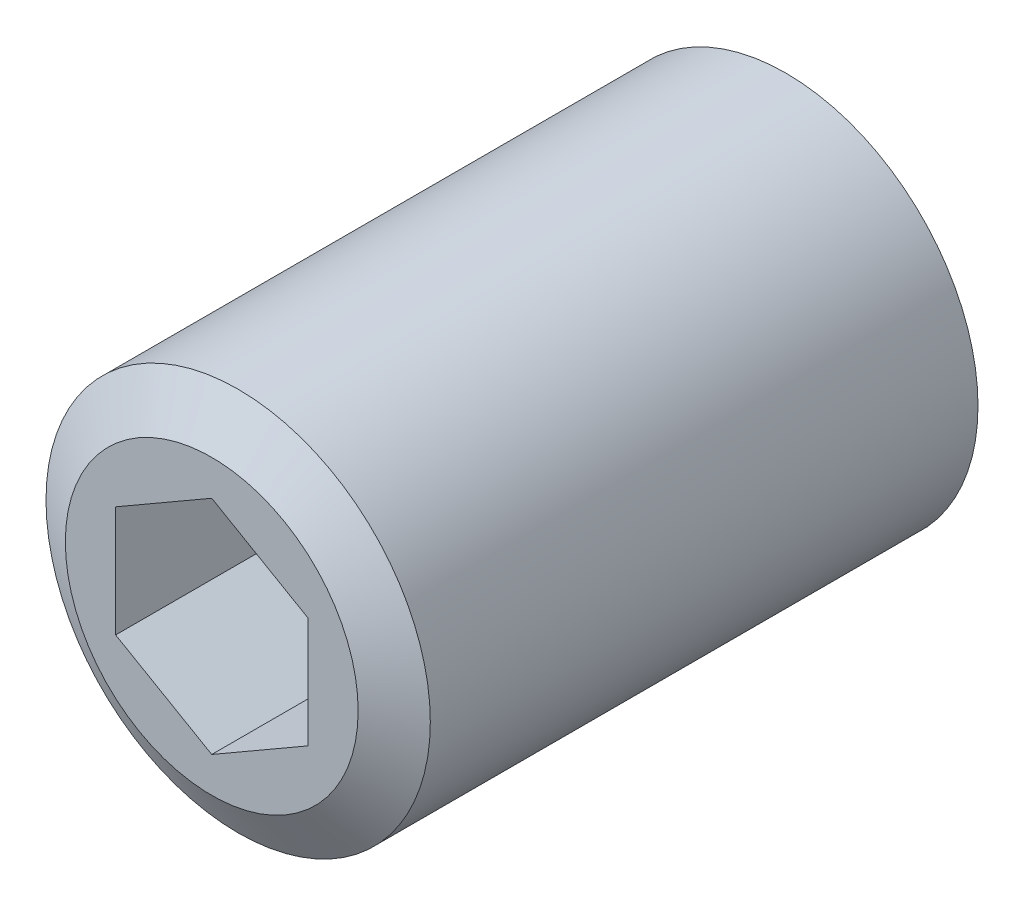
ISO-10303-21;
HEADER;
FILE_DESCRIPTION(('STEP AP214'),'2;1');
FILE_NAME('part.step','',(''),(''),'','','');
FILE_SCHEMA(('AUTOMOTIVE_DESIGN { 1 0 10303 214 1 1 1 1 }'));
ENDSEC;
DATA;
#1=APPLICATION_CONTEXT('core data for automotive mechanical design processes');
#2=APPLICATION_PROTOCOL_DEFINITION('international standard','automotive_design',2000,#1);
#3=PRODUCT_CONTEXT('',#1,'mechanical');
#4=PRODUCT('Part','Part','',(#3));
#5=PRODUCT_RELATED_PRODUCT_CATEGORY('part','',(#4));
#6=PRODUCT_DEFINITION_FORMATION('','',#4);
#7=PRODUCT_DEFINITION_CONTEXT('part definition',#1,'design');
#8=PRODUCT_DEFINITION('design','',#6,#7);
#9=PRODUCT_DEFINITION_SHAPE('','',#8);
#10=(LENGTH_UNIT() NAMED_UNIT(*) SI_UNIT(.MILLI.,.METRE.));
#11=(NAMED_UNIT(*) PLANE_ANGLE_UNIT() SI_UNIT($,.RADIAN.));
#12=(NAMED_UNIT(*) SI_UNIT($,.STERADIAN.) SOLID_ANGLE_UNIT());
#13=UNCERTAINTY_MEASURE_WITH_UNIT(LENGTH_MEASURE(1.E-05),#10,'distance_accuracy_value','');
#14=(GEOMETRIC_REPRESENTATION_CONTEXT(3) GLOBAL_UNCERTAINTY_ASSIGNED_CONTEXT((#13)) GLOBAL_UNIT_ASSIGNED_CONTEXT((#10,
#11,#12)) REPRESENTATION_CONTEXT('',''));
#15=CARTESIAN_POINT('',(0.,0.,0.));
#16=DIRECTION('',(0.,0.,1.));
#17=DIRECTION('',(1.,0.,0.));
#18=AXIS2_PLACEMENT_3D('',#15,#16,#17);
#19=CARTESIAN_POINT('',(0.,0.,0.));
#20=DIRECTION('',(0.,0.,-1.));
#21=DIRECTION('',(-1.,0.,0.));
#22=AXIS2_PLACEMENT_3D('',#19,#20,#21);
#23=PLANE('',#22);
#24=CARTESIAN_POINT('',(0.,0.,0.));
#25=DIRECTION('',(0.,0.,-1.));
#26=DIRECTION('',(-1.,0.,0.));
#27=AXIS2_PLACEMENT_3D('',#24,#25,#26);
#28=CIRCLE('',#27,4.25);
#29=CARTESIAN_POINT('',(-4.25,0.,0.));
#30=VERTEX_POINT('',#29);
#31=EDGE_CURVE('E9',#30,#30,#28,.T.);
#32=ORIENTED_EDGE('',*,*,#31,.T.);
#33=EDGE_LOOP('',(#32));
#34=FACE_BOUND('',#33,.T.);
#35=ADVANCED_FACE('F14',(#34),#23,.T.);
#36=CARTESIAN_POINT('',(0.,0.,-2.));
#37=DIRECTION('',(0.,0.,-1.));
#38=DIRECTION('',(-1.,0.,0.));
#39=AXIS2_PLACEMENT_3D('',#36,#37,#38);
#40=CYLINDRICAL_SURFACE('',#39,4.25);
#41=CARTESIAN_POINT('',(0.,0.,1.5));
#42=DIRECTION('',(0.,0.,-1.));
#43=DIRECTION('',(-1.,0.,0.));
#44=AXIS2_PLACEMENT_3D('',#41,#42,#43);
#45=CIRCLE('',#44,4.25);
#46=CARTESIAN_POINT('',(-4.25,0.,1.5));
#47=VERTEX_POINT('',#46);
#48=EDGE_CURVE('E21',#47,#47,#45,.T.);
#49=ORIENTED_EDGE('',*,*,#48,.T.);
#50=EDGE_LOOP('',(#49));
#51=FACE_BOUND('',#50,.T.);
#52=ORIENTED_EDGE('',*,*,#31,.F.);
#53=EDGE_LOOP('',(#52));
#54=FACE_BOUND('',#53,.T.);
#55=ADVANCED_FACE('F134',(#51,#54),#40,.T.);
#56=CARTESIAN_POINT('',(0.,4.25,1.5));
#57=DIRECTION('',(0.,0.,-1.));
#58=DIRECTION('',(-1.,0.,0.));
#59=AXIS2_PLACEMENT_3D('',#56,#57,#58);
#60=PLANE('',#59);
#61=CARTESIAN_POINT('',(0.,0.,1.5));
#62=DIRECTION('',(0.,0.,-1.));
#63=DIRECTION('',(-1.,0.,0.));
#64=AXIS2_PLACEMENT_3D('',#61,#62,#63);
#65=CIRCLE('',#64,6.094744);
#66=CARTESIAN_POINT('',(-6.094744,0.,1.5));
#67=VERTEX_POINT('',#66);
#68=EDGE_CURVE('E129',#67,#67,#65,.T.);
#69=ORIENTED_EDGE('',*,*,#68,.T.);
#70=EDGE_LOOP('',(#69));
#71=FACE_BOUND('',#70,.T.);
#72=ORIENTED_EDGE('',*,*,#48,.F.);
#73=EDGE_LOOP('',(#72));
#74=FACE_BOUND('',#73,.T.);
#75=ADVANCED_FACE('F137',(#71,#74),#60,.T.);
#76=CARTESIAN_POINT('',(0.,0.,1.5));
#77=DIRECTION('',(0.,0.,1.));
#78=DIRECTION('',(1.,0.,0.));
#79=AXIS2_PLACEMENT_3D('',#76,#77,#78);
#80=CONICAL_SURFACE('',#79,6.094744,1.04719757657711);
#81=CARTESIAN_POINT('',(0.,0.,2.6));
#82=DIRECTION('',(0.,0.,-1.));
#83=DIRECTION('',(-1.,0.,0.));
#84=AXIS2_PLACEMENT_3D('',#81,#82,#83);
#85=CIRCLE('',#84,8.);
#86=CARTESIAN_POINT('',(-8.,0.,2.6));
#87=VERTEX_POINT('',#86);
#88=EDGE_CURVE('E126',#87,#87,#85,.T.);
#89=ORIENTED_EDGE('',*,*,#88,.T.);
#90=EDGE_LOOP('',(#89));
#91=FACE_BOUND('',#90,.T.);
#92=ORIENTED_EDGE('',*,*,#68,.F.);
#93=EDGE_LOOP('',(#92));
#94=FACE_BOUND('',#93,.T.);
#95=ADVANCED_FACE('F139',(#91,#94),#80,.T.);
#96=CARTESIAN_POINT('',(0.,0.,-2.));
#97=DIRECTION('',(0.,0.,-1.));
#98=DIRECTION('',(-1.,0.,0.));
#99=AXIS2_PLACEMENT_3D('',#96,#97,#98);
#100=CYLINDRICAL_SURFACE('',#99,8.);
#101=CARTESIAN_POINT('',(0.,0.,25.4));
#102=DIRECTION('',(0.,0.,-1.));
#103=DIRECTION('',(-1.,0.,0.));
#104=AXIS2_PLACEMENT_3D('',#101,#102,#103);
#105=CIRCLE('',#104,8.);
#106=CARTESIAN_POINT('',(-8.,0.,25.4));
#107=VERTEX_POINT('',#106);
#108=EDGE_CURVE('E123',#107,#107,#105,.T.);
#109=ORIENTED_EDGE('',*,*,#108,.T.);
#110=EDGE_LOOP('',(#109));
#111=FACE_BOUND('',#110,.T.);
#112=ORIENTED_EDGE('',*,*,#88,.F.);
#113=EDGE_LOOP('',(#112));
#114=FACE_BOUND('',#113,.T.);
#115=ADVANCED_FACE('F148',(#111,#114),#100,.T.);
#116=CARTESIAN_POINT('',(0.,0.,25.4));
#117=DIRECTION('',(0.,0.,-1.));
#118=DIRECTION('',(-1.,0.,0.));
#119=AXIS2_PLACEMENT_3D('',#116,#117,#118);
#120=CONICAL_SURFACE('',#119,8.,1.04719757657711);
#121=CARTESIAN_POINT('',(0.,0.,26.5));
#122=DIRECTION('',(0.,0.,-1.));
#123=DIRECTION('',(-1.,0.,0.));
#124=AXIS2_PLACEMENT_3D('',#121,#122,#123);
#125=CIRCLE('',#124,6.094744);
#126=CARTESIAN_POINT('',(-6.094744,0.,26.5));
#127=VERTEX_POINT('',#126);
#128=EDGE_CURVE('E115',#127,#127,#125,.T.);
#129=ORIENTED_EDGE('',*,*,#128,.T.);
#130=EDGE_LOOP('',(#129));
#131=FACE_BOUND('',#130,.T.);
#132=ORIENTED_EDGE('',*,*,#108,.F.);
#133=EDGE_LOOP('',(#132));
#134=FACE_BOUND('',#133,.T.);
#135=ADVANCED_FACE('F187',(#131,#134),#120,.T.);
#136=CARTESIAN_POINT('',(0.,0.,26.5));
#137=DIRECTION('',(0.,0.,1.));
#138=DIRECTION('',(1.,0.,0.));
#139=AXIS2_PLACEMENT_3D('',#136,#137,#138);
#140=PLANE('',#139);
#141=DIRECTION('',(-0.866025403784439,0.5,0.));
#142=VECTOR('',#141,1.);
#143=CARTESIAN_POINT('',(4.,2.30940107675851,26.5));
#144=LINE('',#143,#142);
#145=CARTESIAN_POINT('',(4.,2.30940107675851,26.5));
#146=VERTEX_POINT('',#145);
#147=CARTESIAN_POINT('',(0.,4.61880215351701,26.5));
#148=VERTEX_POINT('',#147);
#149=EDGE_CURVE('E28',#146,#148,#144,.T.);
#150=ORIENTED_EDGE('',*,*,#149,.F.);
#151=DIRECTION('',(0.,1.,0.));
#152=VECTOR('',#151,1.);
#153=CARTESIAN_POINT('',(4.,-2.30940107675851,26.5));
#154=LINE('',#153,#152);
#155=CARTESIAN_POINT('',(4.,-2.30940107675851,26.5));
#156=VERTEX_POINT('',#155);
#157=EDGE_CURVE('E111',#156,#146,#154,.T.);
#158=ORIENTED_EDGE('',*,*,#157,.F.);
#159=DIRECTION('',(0.866025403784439,0.5,0.));
#160=VECTOR('',#159,1.);
#161=CARTESIAN_POINT('',(0.,-4.61880215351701,26.5));
#162=LINE('',#161,#160);
#163=CARTESIAN_POINT('',(0.,-4.61880215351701,26.5));
#164=VERTEX_POINT('',#163);
#165=EDGE_CURVE('E109',#164,#156,#162,.T.);
#166=ORIENTED_EDGE('',*,*,#165,.F.);
#167=DIRECTION('',(0.866025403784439,-0.5,0.));
#168=VECTOR('',#167,1.);
#169=CARTESIAN_POINT('',(-4.,-2.30940107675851,26.5));
#170=LINE('',#169,#168);
#171=CARTESIAN_POINT('',(-4.,-2.30940107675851,26.5));
#172=VERTEX_POINT('',#171);
#173=EDGE_CURVE('E76',#172,#164,#170,.T.);
#174=ORIENTED_EDGE('',*,*,#173,.F.);
#175=DIRECTION('',(0.,-1.,0.));
#176=VECTOR('',#175,1.);
#177=CARTESIAN_POINT('',(-4.,2.30940107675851,26.5));
#178=LINE('',#177,#176);
#179=CARTESIAN_POINT('',(-4.,2.30940107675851,26.5));
#180=VERTEX_POINT('',#179);
#181=EDGE_CURVE('E105',#180,#172,#178,.T.);
#182=ORIENTED_EDGE('',*,*,#181,.F.);
#183=DIRECTION('',(-0.866025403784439,-0.5,0.));
#184=VECTOR('',#183,1.);
#185=CARTESIAN_POINT('',(0.,4.61880215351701,26.5));
#186=LINE('',#185,#184);
#187=EDGE_CURVE('E102',#148,#180,#186,.T.);
#188=ORIENTED_EDGE('',*,*,#187,.F.);
#189=EDGE_LOOP('',(#150,#158,#166,#174,#182,#188));
#190=FACE_BOUND('',#189,.T.);
#191=ORIENTED_EDGE('',*,*,#128,.F.);
#192=EDGE_LOOP('',(#191));
#193=FACE_BOUND('',#192,.T.);
#194=ADVANCED_FACE('F195',(#190,#193),#140,.T.);
#195=CARTESIAN_POINT('',(4.,2.30940107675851,20.5));
#196=DIRECTION('',(0.5,0.866025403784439,0.));
#197=DIRECTION('',(-0.866025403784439,0.5,0.));
#198=AXIS2_PLACEMENT_3D('',#195,#196,#197);
#199=PLANE('',#198);
#200=ORIENTED_EDGE('',*,*,#149,.T.);
#201=DIRECTION('',(0.,0.,1.));
#202=VECTOR('',#201,1.);
#203=CARTESIAN_POINT('',(0.,4.61880215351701,20.5));
#204=LINE('',#203,#202);
#205=CARTESIAN_POINT('',(0.,4.61880215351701,20.5));
#206=VERTEX_POINT('',#205);
#207=EDGE_CURVE('E58',#206,#148,#204,.T.);
#208=ORIENTED_EDGE('',*,*,#207,.F.);
#209=DIRECTION('',(-0.866025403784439,0.5,0.));
#210=VECTOR('',#209,1.);
#211=CARTESIAN_POINT('',(4.,2.30940107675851,20.5));
#212=LINE('',#211,#210);
#213=CARTESIAN_POINT('',(4.,2.30940107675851,20.5));
#214=VERTEX_POINT('',#213);
#215=EDGE_CURVE('E113',#214,#206,#212,.T.);
#216=ORIENTED_EDGE('',*,*,#215,.F.);
#217=DIRECTION('',(0.,0.,1.));
#218=VECTOR('',#217,1.);
#219=CARTESIAN_POINT('',(4.,2.30940107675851,20.5));
#220=LINE('',#219,#218);
#221=EDGE_CURVE('E36',#214,#146,#220,.T.);
#222=ORIENTED_EDGE('',*,*,#221,.T.);
#223=EDGE_LOOP('',(#200,#208,#216,#222));
#224=FACE_BOUND('',#223,.T.);
#225=ADVANCED_FACE('F204',(#224),#199,.F.);
#226=CARTESIAN_POINT('',(4.,-2.30940107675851,20.5));
#227=DIRECTION('',(1.,0.,0.));
#228=DIRECTION('',(0.,0.,-1.));
#229=AXIS2_PLACEMENT_3D('',#226,#227,#228);
#230=PLANE('',#229);
#231=ORIENTED_EDGE('',*,*,#157,.T.);
#232=ORIENTED_EDGE('',*,*,#221,.F.);
#233=DIRECTION('',(0.,1.,0.));
#234=VECTOR('',#233,1.);
#235=CARTESIAN_POINT('',(4.,-2.30940107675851,20.5));
#236=LINE('',#235,#234);
#237=CARTESIAN_POINT('',(4.,-2.30940107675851,20.5));
#238=VERTEX_POINT('',#237);
#239=EDGE_CURVE('E88',#238,#214,#236,.T.);
#240=ORIENTED_EDGE('',*,*,#239,.F.);
#241=DIRECTION('',(0.,0.,1.));
#242=VECTOR('',#241,1.);
#243=CARTESIAN_POINT('',(4.,-2.30940107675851,20.5));
#244=LINE('',#243,#242);
#245=EDGE_CURVE('E80',#238,#156,#244,.T.);
#246=ORIENTED_EDGE('',*,*,#245,.T.);
#247=EDGE_LOOP('',(#231,#232,#240,#246));
#248=FACE_BOUND('',#247,.T.);
#249=ADVANCED_FACE('F213',(#248),#230,.F.);
#250=CARTESIAN_POINT('',(0.,-4.61880215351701,20.5));
#251=DIRECTION('',(0.5,-0.866025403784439,0.));
#252=DIRECTION('',(0.866025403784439,0.5,0.));
#253=AXIS2_PLACEMENT_3D('',#250,#251,#252);
#254=PLANE('',#253);
#255=ORIENTED_EDGE('',*,*,#165,.T.);
#256=ORIENTED_EDGE('',*,*,#245,.F.);
#257=DIRECTION('',(0.866025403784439,0.5,0.));
#258=VECTOR('',#257,1.);
#259=CARTESIAN_POINT('',(0.,-4.61880215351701,20.5));
#260=LINE('',#259,#258);
#261=CARTESIAN_POINT('',(0.,-4.61880215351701,20.5));
#262=VERTEX_POINT('',#261);
#263=EDGE_CURVE('E84',#262,#238,#260,.T.);
#264=ORIENTED_EDGE('',*,*,#263,.F.);
#265=DIRECTION('',(0.,0.,1.));
#266=VECTOR('',#265,1.);
#267=CARTESIAN_POINT('',(0.,-4.61880215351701,20.5));
#268=LINE('',#267,#266);
#269=EDGE_CURVE('E69',#262,#164,#268,.T.);
#270=ORIENTED_EDGE('',*,*,#269,.T.);
#271=EDGE_LOOP('',(#255,#256,#264,#270));
#272=FACE_BOUND('',#271,.T.);
#273=ADVANCED_FACE('F85',(#272),#254,.F.);
#274=CARTESIAN_POINT('',(-4.,-2.30940107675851,20.5));
#275=DIRECTION('',(-0.5,-0.866025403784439,0.));
#276=DIRECTION('',(0.866025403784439,-0.5,0.));
#277=AXIS2_PLACEMENT_3D('',#274,#275,#276);
#278=PLANE('',#277);
#279=ORIENTED_EDGE('',*,*,#173,.T.);
#280=ORIENTED_EDGE('',*,*,#269,.F.);
#281=DIRECTION('',(0.866025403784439,-0.5,0.));
#282=VECTOR('',#281,1.);
#283=CARTESIAN_POINT('',(-4.,-2.30940107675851,20.5));
#284=LINE('',#283,#282);
#285=CARTESIAN_POINT('',(-4.,-2.30940107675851,20.5));
#286=VERTEX_POINT('',#285);
#287=EDGE_CURVE('E73',#286,#262,#284,.T.);
#288=ORIENTED_EDGE('',*,*,#287,.F.);
#289=DIRECTION('',(0.,0.,1.));
#290=VECTOR('',#289,1.);
#291=CARTESIAN_POINT('',(-4.,-2.30940107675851,20.5));
#292=LINE('',#291,#290);
#293=EDGE_CURVE('E81',#286,#172,#292,.T.);
#294=ORIENTED_EDGE('',*,*,#293,.T.);
#295=EDGE_LOOP('',(#279,#280,#288,#294));
#296=FACE_BOUND('',#295,.T.);
#297=ADVANCED_FACE('F71',(#296),#278,.F.);
#298=CARTESIAN_POINT('',(-4.,2.30940107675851,20.5));
#299=DIRECTION('',(-1.,0.,0.));
#300=DIRECTION('',(0.,-1.,0.));
#301=AXIS2_PLACEMENT_3D('',#298,#299,#300);
#302=PLANE('',#301);
#303=ORIENTED_EDGE('',*,*,#181,.T.);
#304=ORIENTED_EDGE('',*,*,#293,.F.);
#305=DIRECTION('',(0.,-1.,0.));
#306=VECTOR('',#305,1.);
#307=CARTESIAN_POINT('',(-4.,2.30940107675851,20.5));
#308=LINE('',#307,#306);
#309=CARTESIAN_POINT('',(-4.,2.30940107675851,20.5));
#310=VERTEX_POINT('',#309);
#311=EDGE_CURVE('E94',#310,#286,#308,.T.);
#312=ORIENTED_EDGE('',*,*,#311,.F.);
#313=DIRECTION('',(0.,0.,1.));
#314=VECTOR('',#313,1.);
#315=CARTESIAN_POINT('',(-4.,2.30940107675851,20.5));
#316=LINE('',#315,#314);
#317=EDGE_CURVE('E118',#310,#180,#316,.T.);
#318=ORIENTED_EDGE('',*,*,#317,.T.);
#319=EDGE_LOOP('',(#303,#304,#312,#318));
#320=FACE_BOUND('',#319,.T.);
#321=ADVANCED_FACE('F235',(#320),#302,.F.);
#322=CARTESIAN_POINT('',(0.,4.61880215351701,20.5));
#323=DIRECTION('',(-0.5,0.866025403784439,0.));
#324=DIRECTION('',(-0.866025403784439,-0.5,0.));
#325=AXIS2_PLACEMENT_3D('',#322,#323,#324);
#326=PLANE('',#325);
#327=ORIENTED_EDGE('',*,*,#187,.T.);
#328=ORIENTED_EDGE('',*,*,#317,.F.);
#329=DIRECTION('',(-0.866025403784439,-0.5,0.));
#330=VECTOR('',#329,1.);
#331=CARTESIAN_POINT('',(0.,4.61880215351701,20.5));
#332=LINE('',#331,#330);
#333=EDGE_CURVE('E96',#206,#310,#332,.T.);
#334=ORIENTED_EDGE('',*,*,#333,.F.);
#335=ORIENTED_EDGE('',*,*,#207,.T.);
#336=EDGE_LOOP('',(#327,#328,#334,#335));
#337=FACE_BOUND('',#336,.T.);
#338=ADVANCED_FACE('F243',(#337),#326,.F.);
#339=CARTESIAN_POINT('',(0.,4.61880215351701,20.5));
#340=DIRECTION('',(0.,0.,1.));
#341=DIRECTION('',(1.,0.,0.));
#342=AXIS2_PLACEMENT_3D('',#339,#340,#341);
#343=PLANE('',#342);
#344=ORIENTED_EDGE('',*,*,#215,.T.);
#345=ORIENTED_EDGE('',*,*,#333,.T.);
#346=ORIENTED_EDGE('',*,*,#311,.T.);
#347=ORIENTED_EDGE('',*,*,#287,.T.);
#348=ORIENTED_EDGE('',*,*,#263,.T.);
#349=ORIENTED_EDGE('',*,*,#239,.T.);
#350=EDGE_LOOP('',(#344,#345,#346,#347,#348,#349));
#351=FACE_BOUND('',#350,.T.);
#352=ADVANCED_FACE('F91',(#351),#343,.T.);
#353=CLOSED_SHELL('',(#35,#55,#75,#95,#115,#135,#194,#225,#249,#273,#297,#321,#338,#352));
#354=MANIFOLD_SOLID_BREP('B1',#353);
#355=ADVANCED_BREP_SHAPE_REPRESENTATION('',(#18,#354),#14);
#356=SHAPE_DEFINITION_REPRESENTATION(#9,#355);
ENDSEC;
END-ISO-10303-21;
